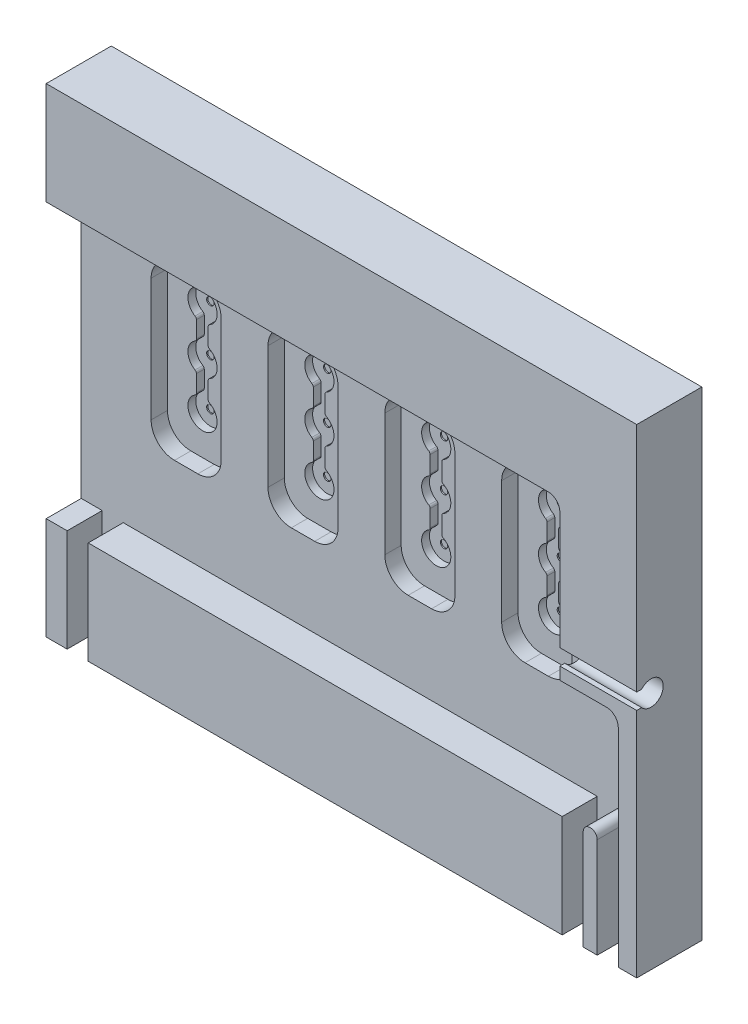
from build123d import *

# Parameters (mm, degrees)
SKETCH1_W           = 48
SKETCH1_H           = 31.47
EXTRUDE1_DEPTH      = 5.15
CUT_EXTRUDE1_DEPTH  = 2.58
CUT_EXTRUDE2_DEPTH  = 2.07
CUT_EXTRUDE6_DEPTH  = 1.4
LPATTERN1_COUNT     = 4
LPATTERN1_PITCH     = 10
SKETCH7_R           = 0.3175
CUT_EXTRUDE3_DEPTH  = 0.1
LPATTERN2_COUNT     = 4
LPATTERN2_PITCH     = 10
SKETCH11_W          = 6
SKETCH11_H          = 23.47
CUT_EXTRUDE7_DEPTH  = 2.58
SKETCH16_W          = 5.15
SKETCH16_H          = 31.47
EXTRUDE2_DEPTH      = 2.58
CUT_EXTRUDE11_REACH = 61.793
SKETCH17_R          = 1.05
CUT_EXTRUDE9_DEPTH  = 2.58
SKETCH18_W          = 1.4
SKETCH18_H          = 3.78233579
SKETCH18_W_2        = 44
SKETCH18_H_2        = 4
EXTRUDE3_DEPTH      = 0.42
CUT_EXTRUDE12_DEPTH = 0.04
SKETCH20_W          = 0.2
SKETCH20_H          = 4
EXTRUDE4_DEPTH      = 3
SKETCH21_W          = 0.2
SKETCH21_H          = 3.78233579
CUT_EXTRUDE13_DEPTH = 3
SKETCH24_R          = 0.6
EXTRUDE5_DEPTH      = 3
SKETCH25_W          = 50.54
SKETCH25_H          = 4.775
EXTRUDE6_DEPTH      = 5.57
SKETCH26_W          = 1.8
SKETCH26_H          = 4.775
CUT_EXTRUDE14_DEPTH = 3
FILLET1_R           = 1
FILLET2_R           = 1
SKETCH27_W          = 1.8
SKETCH27_H          = 8.775
CUT_EXTRUDE16_DEPTH = 3


with BuildPart() as part:
    # Sketch1 → Extrude1 (new body)
    with BuildSketch(Plane.XY):
        with Locations((24, 15.735)):
            Rectangle(SKETCH1_W, SKETCH1_H)
    extrude(amount=EXTRUDE1_DEPTH)

    # Sketch2 → Cut-Extrude1 (cut)
    with BuildSketch(Plane.XY.offset(5.15)):
        with BuildLine():
            Line((6, 27.47), (42, 27.47))
            Line((42, 27.47), (44, 27.47))
            Line((44, 27.47), (44, 25.47))
            Line((44, 25.47), (44, 6))
            ThreePointArc((44, 6), (43.414213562, 4.585786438), (42, 4))
            Line((42, 4), (6, 4))
            ThreePointArc((6, 4), (4.585786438, 4.585786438), (4, 6))
            Line((4, 6), (4, 25.47))
            ThreePointArc((4, 25.47), (4.585786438, 26.884213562), (6, 27.47))
        make_face()
    extrude(amount=-CUT_EXTRUDE1_DEPTH, mode=Mode.SUBTRACT)

    # Sketch6 → Cut-Extrude2 (cut)
    with BuildSketch(Plane.XY.offset(2.57)):
        with BuildLine():
            Line((8.497883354, 20.773984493), (8.497883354, 19.346015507))
            ThreePointArc((8.497883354, 19.346015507), (8.46545119, 19.222872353), (8.376569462, 19.131679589))
            ThreePointArc((8.376569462, 19.131679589), (7.77, 18.06), (8.376569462, 16.988320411))
            ThreePointArc((8.376569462, 16.988320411), (8.46545119, 16.897127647), (8.497883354, 16.773984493))
            Line((8.497883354, 16.773984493), (8.497883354, 15.346015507))
            ThreePointArc((8.497883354, 15.346015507), (8.46545119, 15.222872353), (8.376569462, 15.131679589))
            ThreePointArc((8.376569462, 15.131679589), (9.041282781, 12.810181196), (9.626569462, 15.152965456))
            ThreePointArc((9.626569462, 15.152965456), (9.532443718, 15.244728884), (9.497883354, 15.371558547))
            Line((9.497883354, 15.371558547), (9.497883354, 16.748441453))
            ThreePointArc((9.497883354, 16.748441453), (9.532443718, 16.875271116), (9.626569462, 16.967034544))
            ThreePointArc((9.626569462, 16.967034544), (10.27, 18.06), (9.626569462, 19.152965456))
            ThreePointArc((9.626569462, 19.152965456), (9.532443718, 19.244728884), (9.497883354, 19.371558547))
            Line((9.497883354, 19.371558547), (9.497883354, 20.748441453))
            ThreePointArc((9.497883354, 20.748441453), (9.532443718, 20.875271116), (9.626569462, 20.967034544))
            ThreePointArc((9.626569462, 20.967034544), (9.041282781, 23.309818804), (8.376569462, 20.988320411))
            ThreePointArc((8.376569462, 20.988320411), (8.46545119, 20.897127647), (8.497883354, 20.773984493))
        make_face()
    cut_extrude2 = extrude(amount=-CUT_EXTRUDE2_DEPTH, mode=Mode.SUBTRACT)

    # Sketch10 → Cut-Extrude6 (cut)
    with BuildSketch(Plane.XY.offset(2.57)):
        with BuildLine():
            Line((10.02, 10.810181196), (8.02, 10.810181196))
            ThreePointArc((8.02, 10.810181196), (6.605786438, 11.395967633), (6.02, 12.810181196))
            Line((6.02, 12.810181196), (6.02, 23.309818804))
            ThreePointArc((6.02, 23.309818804), (6.605786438, 24.724032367), (8.02, 25.309818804))
            Line((8.02, 25.309818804), (10.02, 25.309818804))
            ThreePointArc((10.02, 25.309818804), (11.434213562, 24.724032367), (12.02, 23.309818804))
            Line((12.02, 23.309818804), (12.02, 12.810181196))
            ThreePointArc((12.02, 12.810181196), (11.434213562, 11.395967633), (10.02, 10.810181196))
        make_face()
    cut_extrude6 = extrude(amount=-CUT_EXTRUDE6_DEPTH, mode=Mode.SUBTRACT)

    # LPattern1: Cut-Extrude2, Cut-Extrude6 ×4
    with Locations(*[(i * LPATTERN1_PITCH, 0, 0) for i in range(1, LPATTERN1_COUNT)]):
        add(cut_extrude2, mode=Mode.SUBTRACT)
        add(cut_extrude6, mode=Mode.SUBTRACT)

    # Sketch7 → Cut-Extrude3 (cut)
    with BuildSketch(Plane.XY.offset(0.5)):
        with Locations((9.02, 22.06)):
            Circle(SKETCH7_R)
        with Locations((9.02, 18.06)):
            Circle(SKETCH7_R)
        with Locations((9.02, 14.06)):
            Circle(SKETCH7_R)
    cut_extrude3 = extrude(amount=-CUT_EXTRUDE3_DEPTH, mode=Mode.SUBTRACT)

    # LPattern2: Cut-Extrude3 ×4
    with Locations(*[(i * LPATTERN2_PITCH, 0, 0) for i in range(1, LPATTERN2_COUNT)]):
        add(cut_extrude3, mode=Mode.SUBTRACT)

    # Sketch11 → Cut-Extrude7 (cut)
    with BuildSketch(Plane.XY.offset(5.15)):
        with Locations((3, 15.735)):
            Rectangle(SKETCH11_W, SKETCH11_H)
    extrude(amount=-CUT_EXTRUDE7_DEPTH, mode=Mode.SUBTRACT)

    # Sketch16 → Extrude2 (add)
    with BuildSketch(Plane(origin=(48, 0, 0), x_dir=(0, 0, -1), z_dir=(1, 0, 0))):
        with Locations((-2.575, 15.735)):
            Rectangle(SKETCH16_W, SKETCH16_H)
    extrude(amount=EXTRUDE2_DEPTH)

    # Sketch17 → Cut-Extrude11 (cut, up to next)
    with BuildSketch(Plane(origin=(50.58, 0, 0), x_dir=(0, 0, -1), z_dir=(1, 0, 0)), mode=Mode.PRIVATE) as cut_extrude11_sk1:
        with Locations((-4.35, 15.735)):
            Circle(SKETCH17_R)
    cut_extrude11_tool1 = extrude(cut_extrude11_sk1.sketch, amount=-CUT_EXTRUDE11_REACH, mode=Mode.PRIVATE) & part.part
    add(cut_extrude11_tool1.solids().sort_by_distance((50.58, 15.735, 4.35))[0], mode=Mode.SUBTRACT)

    # Sketch14 → Cut-Extrude9 (cut)
    with BuildSketch(Plane.XY.offset(5.15)):
        Polygon((49, 0), (47.2, 0), (47.2, 3.78233579), (45.8, 3.78233579), (45.8, 0), (44, 0), (44, 4), (42, 4), (42, 6), (44, 6), (44, 14), (49, 14), align=None)
    extrude(amount=-CUT_EXTRUDE9_DEPTH, mode=Mode.SUBTRACT)

    # Sketch18 → Extrude3 (add)
    with BuildSketch(Plane.XY.offset(5.15)):
        Polygon((44, 27.47), (44, 16.415073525), (50.58, 16.415073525), (50.58, 31.47), (0, 31.47), (0, 27.47), align=None)
        Polygon((44, 14), (49, 14), (49, 0), (50.58, 0), (50.58, 15.054926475), (44, 15.054926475), align=None)
        with Locations((46.5, 1.891167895)):
            Rectangle(SKETCH18_W, SKETCH18_H)
        with Locations((22, 2)):
            Rectangle(SKETCH18_W_2, SKETCH18_H_2)
    extrude(amount=EXTRUDE3_DEPTH)

    # Sketch19 → Cut-Extrude12 (cut)
    with BuildSketch(Plane.ZY):
        Polygon((0, 0), (5.57, 0), (5.57, 4), (2.57, 4), (2.57, 27.47), (5.57, 27.47), (5.57, 31.47), (0, 31.47), align=None)
    extrude(amount=-CUT_EXTRUDE12_DEPTH, mode=Mode.SUBTRACT)

    # Sketch20 → Extrude4 (add)
    with BuildSketch(Plane.XY.offset(5.57)):
        with Locations((44.1, 2)):
            Rectangle(SKETCH20_W, SKETCH20_H)
    extrude(amount=-EXTRUDE4_DEPTH)

    # Sketch21 → Cut-Extrude13 (cut)
    with BuildSketch(Plane.XY.offset(5.57)):
        with Locations((45.9, 1.891167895)):
            Rectangle(SKETCH21_W, SKETCH21_H)
    extrude(amount=-CUT_EXTRUDE13_DEPTH, mode=Mode.SUBTRACT)

    # Sketch24 → Extrude5 (add)
    with BuildSketch(Plane.XY.offset(5.57)):
        with Locations((46.6, 3.78233579)):
            Circle(SKETCH24_R)
    extrude(amount=-EXTRUDE5_DEPTH)

    # Sketch25 → Extrude6 (add)
    with BuildSketch(Plane.XY.offset(5.57)):
        with Locations((25.31, 33.8575)):
            Rectangle(SKETCH25_W, SKETCH25_H)
        with Locations((25.31, -2.3875)):
            Rectangle(SKETCH25_W, SKETCH25_H)
    extrude(amount=-EXTRUDE6_DEPTH)

    # Sketch26 → Cut-Extrude14 (cut)
    with BuildSketch(Plane.XY.offset(5.57)):
        with Locations((45.1, -2.3875)):
            Rectangle(SKETCH26_W, SKETCH26_H)
        with Locations((48.1, -2.3875)):
            Rectangle(SKETCH26_W, SKETCH26_H)
    extrude(amount=-CUT_EXTRUDE14_DEPTH, mode=Mode.SUBTRACT)

    # Fillet1
    fillet1_edges = [part.edges().sort_by_distance(p)[0] for p in [
        (49, 14, 4.07),
    ]]
    fillet(fillet1_edges, radius=FILLET1_R)

    # Fillet2
    fillet2_edges = [part.edges().sort_by_distance(p)[0] for p in [
        (44, 27.47, 4.07),
    ]]
    fillet(fillet2_edges, radius=FILLET2_R)

    # Sketch27 → Cut-Extrude16 (cut)
    with BuildSketch(Plane.XY.offset(5.57)):
        with Locations((2.73601089, -0.3875)):
            Rectangle(SKETCH27_W, SKETCH27_H)
    extrude(amount=-CUT_EXTRUDE16_DEPTH, mode=Mode.SUBTRACT)


solid = part.part
